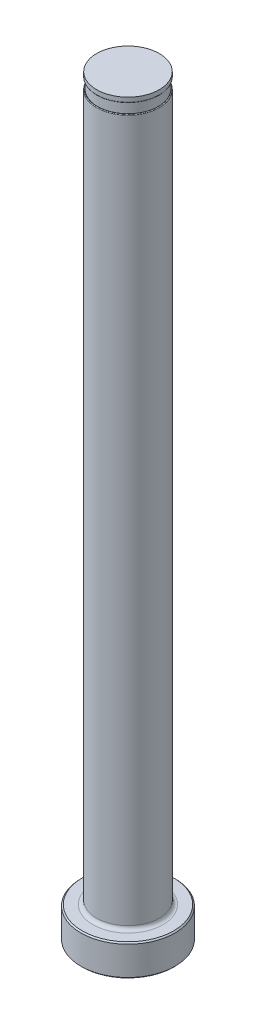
ISO-10303-21;
HEADER;
FILE_DESCRIPTION(('STEP AP214'),'2;1');
FILE_NAME('part.step','',(''),(''),'','','');
FILE_SCHEMA(('AUTOMOTIVE_DESIGN { 1 0 10303 214 1 1 1 1 }'));
ENDSEC;
DATA;
#1=APPLICATION_CONTEXT('core data for automotive mechanical design processes');
#2=APPLICATION_PROTOCOL_DEFINITION('international standard','automotive_design',2000,#1);
#3=PRODUCT_CONTEXT('',#1,'mechanical');
#4=PRODUCT('Part','Part','',(#3));
#5=PRODUCT_RELATED_PRODUCT_CATEGORY('part','',(#4));
#6=PRODUCT_DEFINITION_FORMATION('','',#4);
#7=PRODUCT_DEFINITION_CONTEXT('part definition',#1,'design');
#8=PRODUCT_DEFINITION('design','',#6,#7);
#9=PRODUCT_DEFINITION_SHAPE('','',#8);
#10=(LENGTH_UNIT() NAMED_UNIT(*) SI_UNIT(.MILLI.,.METRE.));
#11=(NAMED_UNIT(*) PLANE_ANGLE_UNIT() SI_UNIT($,.RADIAN.));
#12=(NAMED_UNIT(*) SI_UNIT($,.STERADIAN.) SOLID_ANGLE_UNIT());
#13=UNCERTAINTY_MEASURE_WITH_UNIT(LENGTH_MEASURE(1.E-05),#10,'distance_accuracy_value','');
#14=(GEOMETRIC_REPRESENTATION_CONTEXT(3) GLOBAL_UNCERTAINTY_ASSIGNED_CONTEXT((#13)) GLOBAL_UNIT_ASSIGNED_CONTEXT((#10,
#11,#12)) REPRESENTATION_CONTEXT('',''));
#15=CARTESIAN_POINT('',(0.,0.,0.));
#16=DIRECTION('',(0.,0.,1.));
#17=DIRECTION('',(1.,0.,0.));
#18=AXIS2_PLACEMENT_3D('',#15,#16,#17);
#19=CARTESIAN_POINT('',(-6.34999999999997,151.384,0.));
#20=DIRECTION('',(0.,1.,0.));
#21=DIRECTION('',(0.,0.,1.));
#22=AXIS2_PLACEMENT_3D('',#19,#20,#21);
#23=PLANE('',#22);
#24=CARTESIAN_POINT('',(0.,151.384,0.));
#25=DIRECTION('',(0.,1.,0.));
#26=DIRECTION('',(0.,0.,1.));
#27=AXIS2_PLACEMENT_3D('',#24,#25,#26);
#28=CIRCLE('',#27,6.21791999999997);
#29=CARTESIAN_POINT('',(0.,151.384,6.21791999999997));
#30=VERTEX_POINT('',#29);
#31=EDGE_CURVE('E11',#30,#30,#28,.F.);
#32=ORIENTED_EDGE('',*,*,#31,.T.);
#33=EDGE_LOOP('',(#32));
#34=FACE_BOUND('',#33,.T.);
#35=CARTESIAN_POINT('',(0.,151.384,0.));
#36=DIRECTION('',(0.,1.,0.));
#37=DIRECTION('',(0.,0.,1.));
#38=AXIS2_PLACEMENT_3D('',#35,#36,#37);
#39=CIRCLE('',#38,6.14679999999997);
#40=CARTESIAN_POINT('',(0.,151.384,6.14679999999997));
#41=VERTEX_POINT('',#40);
#42=EDGE_CURVE('E78',#41,#41,#39,.T.);
#43=ORIENTED_EDGE('',*,*,#42,.T.);
#44=EDGE_LOOP('',(#43));
#45=FACE_BOUND('',#44,.T.);
#46=ADVANCED_FACE('F36',(#34,#45),#23,.F.);
#47=CARTESIAN_POINT('',(0.,259.958771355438,0.));
#48=DIRECTION('',(0.,1.,0.));
#49=DIRECTION('',(0.,0.,1.));
#50=AXIS2_PLACEMENT_3D('',#47,#48,#49);
#51=CYLINDRICAL_SURFACE('',#50,6.34999999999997);
#52=DIRECTION('',(0.,1.,0.));
#53=VECTOR('',#52,1.);
#54=CARTESIAN_POINT('',(-6.14679999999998,259.958771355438,-1.59353373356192));
#55=LINE('',#54,#53);
#56=CARTESIAN_POINT('',(-6.14679999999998,149.225,-1.59353373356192));
#57=VERTEX_POINT('',#56);
#58=CARTESIAN_POINT('',(-6.14679999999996,86.868,-1.59353373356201));
#59=VERTEX_POINT('',#58);
#60=EDGE_CURVE('E73',#57,#59,#55,.F.);
#61=ORIENTED_EDGE('',*,*,#60,.F.);
#62=CARTESIAN_POINT('',(0.,149.225,0.));
#63=DIRECTION('',(0.,-1.,0.));
#64=DIRECTION('',(0.,0.,-1.));
#65=AXIS2_PLACEMENT_3D('',#62,#63,#64);
#66=CIRCLE('',#65,6.34999999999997);
#67=CARTESIAN_POINT('',(-6.14679999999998,149.225,1.59353373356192));
#68=VERTEX_POINT('',#67);
#69=EDGE_CURVE('E51',#57,#68,#66,.T.);
#70=ORIENTED_EDGE('',*,*,#69,.T.);
#71=DIRECTION('',(0.,1.,0.));
#72=VECTOR('',#71,1.);
#73=CARTESIAN_POINT('',(-6.14679999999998,259.958771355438,1.59353373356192));
#74=LINE('',#73,#72);
#75=CARTESIAN_POINT('',(-6.14679999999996,86.868,1.59353373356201));
#76=VERTEX_POINT('',#75);
#77=EDGE_CURVE('E84',#76,#68,#74,.T.);
#78=ORIENTED_EDGE('',*,*,#77,.F.);
#79=CARTESIAN_POINT('',(-6.14679999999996,86.868,-1.59353373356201));
#80=CARTESIAN_POINT('',(-6.14679686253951,86.8404663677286,-1.59353938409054));
#81=CARTESIAN_POINT('',(-6.14715862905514,86.8129529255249,-1.59215087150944));
#82=CARTESIAN_POINT('',(-6.14858031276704,86.7582441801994,-1.58665454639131));
#83=CARTESIAN_POINT('',(-6.1496395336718,86.7310485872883,-1.58254944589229));
#84=CARTESIAN_POINT('',(-6.15378495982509,86.6508935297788,-1.56638373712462));
#85=CARTESIAN_POINT('',(-6.15784047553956,86.5987192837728,-1.55046902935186));
#86=CARTESIAN_POINT('',(-6.16796669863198,86.4985368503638,-1.50967436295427));
#87=CARTESIAN_POINT('',(-6.17403041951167,86.4505149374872,-1.48482546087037));
#88=CARTESIAN_POINT('',(-6.18749023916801,86.3592134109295,-1.42770042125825));
#89=CARTESIAN_POINT('',(-6.19488985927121,86.3159468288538,-1.39540459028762));
#90=CARTESIAN_POINT('',(-6.2128308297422,86.2215154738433,-1.31357934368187));
#91=CARTESIAN_POINT('',(-6.22361527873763,86.1723096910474,-1.26185217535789));
#92=CARTESIAN_POINT('',(-6.24504791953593,86.0829285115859,-1.15112070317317));
#93=CARTESIAN_POINT('',(-6.25569585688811,86.0427681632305,-1.09210452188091));
#94=CARTESIAN_POINT('',(-6.27981252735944,85.9571635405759,-0.945436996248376));
#95=CARTESIAN_POINT('',(-6.29280304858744,85.9155705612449,-0.855464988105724));
#96=CARTESIAN_POINT('',(-6.3152685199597,85.84688021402,-0.66983216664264));
#97=CARTESIAN_POINT('',(-6.32474033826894,85.8197957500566,-0.574166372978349));
#98=CARTESIAN_POINT('',(-6.33958312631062,85.7782724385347,-0.377105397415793));
#99=CARTESIAN_POINT('',(-6.34483489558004,85.764199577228,-0.275625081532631));
#100=CARTESIAN_POINT('',(-6.35041977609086,85.7492595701,-0.0715187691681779));
#101=CARTESIAN_POINT('',(-6.35074885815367,85.748403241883,0.0311080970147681));
#102=CARTESIAN_POINT('',(-6.34600640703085,85.7610416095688,0.256717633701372));
#103=CARTESIAN_POINT('',(-6.33980431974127,85.7775397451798,0.379522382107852));
#104=CARTESIAN_POINT('',(-6.32079279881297,85.8309790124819,0.620117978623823));
#105=CARTESIAN_POINT('',(-6.30799326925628,85.8678895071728,0.737916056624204));
#106=CARTESIAN_POINT('',(-6.28320612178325,85.9468252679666,0.921417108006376));
#107=CARTESIAN_POINT('',(-6.27266140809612,85.9819385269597,0.990304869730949));
#108=CARTESIAN_POINT('',(-6.25047734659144,86.0621826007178,1.12180209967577));
#109=CARTESIAN_POINT('',(-6.23883987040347,86.1072964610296,1.18442193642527));
#110=CARTESIAN_POINT('',(-6.21836351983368,86.1965218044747,1.28706750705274));
#111=CARTESIAN_POINT('',(-6.20949901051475,86.2384586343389,1.32897137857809));
#112=CARTESIAN_POINT('',(-6.19260904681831,86.328662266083,1.40556985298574));
#113=CARTESIAN_POINT('',(-6.18458268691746,86.3769221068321,1.44027227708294));
#114=CARTESIAN_POINT('',(-6.17157345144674,86.469899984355,1.49493371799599));
#115=CARTESIAN_POINT('',(-6.16630262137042,86.5136744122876,1.51642497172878));
#116=CARTESIAN_POINT('',(-6.1574469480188,86.6042717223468,1.55199425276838));
#117=CARTESIAN_POINT('',(-6.15385883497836,86.6510884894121,1.56608666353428));
#118=CARTESIAN_POINT('',(-6.14982923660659,86.7265672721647,1.58181403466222));
#119=CARTESIAN_POINT('',(-6.14869942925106,86.7546434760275,1.58619374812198));
#120=CARTESIAN_POINT('',(-6.14718237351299,86.8111398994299,1.59205902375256));
#121=CARTESIAN_POINT('',(-6.14679576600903,86.8395603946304,1.59354208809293));
#122=CARTESIAN_POINT('',(-6.14679999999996,86.868,1.59353373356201));
#123=B_SPLINE_CURVE_WITH_KNOTS('',3,(#79,#80,#81,#82,#83,#84,#85,#86,#87,#88,#89,#90,#91,#92,
#93,#94,#95,#96,#97,#98,#99,#100,#101,#102,#103,#104,#105,#106,#107,#108,#109,#110,#111,#112,
#113,#114,#115,#116,#117,#118,#119,#120,#121,#122),.UNSPECIFIED.,.F.,.F.,(4,2,2,2,2,2,2,2,2,2,2,
2,2,2,2,2,2,2,2,2,2,4),(0.,0.0825255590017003,0.16496885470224,0.327951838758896,
0.490373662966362,0.653230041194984,0.868657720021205,1.08444118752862,1.38273372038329,
1.68129111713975,1.9880112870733,2.29498249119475,2.66541500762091,3.03529304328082,
3.26869881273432,3.50171186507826,3.68091203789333,3.85991655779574,4.00647458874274,
4.15274664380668,4.23791544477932,4.32315765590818),.UNSPECIFIED.);
#124=EDGE_CURVE('E81',#59,#76,#123,.T.);
#125=ORIENTED_EDGE('',*,*,#124,.F.);
#126=EDGE_LOOP('',(#61,#70,#78,#125));
#127=FACE_BOUND('',#126,.T.);
#128=CARTESIAN_POINT('',(0.,7.11200000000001,0.));
#129=DIRECTION('',(0.,1.,0.));
#130=DIRECTION('',(0.,0.,1.));
#131=AXIS2_PLACEMENT_3D('',#128,#129,#130);
#132=CIRCLE('',#131,6.34999999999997);
#133=CARTESIAN_POINT('',(0.,7.11200000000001,6.34999999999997));
#134=VERTEX_POINT('',#133);
#135=EDGE_CURVE('E116',#134,#134,#132,.T.);
#136=ORIENTED_EDGE('',*,*,#135,.T.);
#137=EDGE_LOOP('',(#136));
#138=FACE_BOUND('',#137,.T.);
#139=ADVANCED_FACE('F82',(#127,#138),#51,.T.);
#140=CARTESIAN_POINT('',(0.,0.,0.));
#141=DIRECTION('',(0.,-1.,0.));
#142=DIRECTION('',(0.,0.,-1.));
#143=AXIS2_PLACEMENT_3D('',#140,#141,#142);
#144=PLANE('',#143);
#145=CARTESIAN_POINT('',(0.,0.,0.));
#146=DIRECTION('',(0.,-1.,0.));
#147=DIRECTION('',(0.,0.,-1.));
#148=AXIS2_PLACEMENT_3D('',#145,#146,#147);
#149=CIRCLE('',#148,9.271);
#150=CARTESIAN_POINT('',(0.,0.,-9.271));
#151=VERTEX_POINT('',#150);
#152=EDGE_CURVE('E113',#151,#151,#149,.T.);
#153=ORIENTED_EDGE('',*,*,#152,.T.);
#154=EDGE_LOOP('',(#153));
#155=FACE_BOUND('',#154,.T.);
#156=ADVANCED_FACE('F192',(#155),#144,.T.);
#157=CARTESIAN_POINT('',(0.,259.958771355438,0.));
#158=DIRECTION('',(0.,1.,0.));
#159=DIRECTION('',(0.,0.,1.));
#160=AXIS2_PLACEMENT_3D('',#157,#158,#159);
#161=CYLINDRICAL_SURFACE('',#160,9.52499999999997);
#162=CARTESIAN_POINT('',(0.,6.09600000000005,0.));
#163=DIRECTION('',(0.,1.,0.));
#164=DIRECTION('',(0.,0.,1.));
#165=AXIS2_PLACEMENT_3D('',#162,#163,#164);
#166=CIRCLE('',#165,9.52499999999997);
#167=CARTESIAN_POINT('',(0.,6.09600000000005,9.52499999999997));
#168=VERTEX_POINT('',#167);
#169=EDGE_CURVE('E110',#168,#168,#166,.F.);
#170=ORIENTED_EDGE('',*,*,#169,.T.);
#171=EDGE_LOOP('',(#170));
#172=FACE_BOUND('',#171,.T.);
#173=CARTESIAN_POINT('',(0.,0.253999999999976,0.));
#174=DIRECTION('',(0.,-1.,0.));
#175=DIRECTION('',(0.,0.,-1.));
#176=AXIS2_PLACEMENT_3D('',#173,#174,#175);
#177=CIRCLE('',#176,9.52499999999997);
#178=CARTESIAN_POINT('',(0.,0.253999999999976,-9.52499999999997));
#179=VERTEX_POINT('',#178);
#180=EDGE_CURVE('E107',#179,#179,#177,.F.);
#181=ORIENTED_EDGE('',*,*,#180,.T.);
#182=EDGE_LOOP('',(#181));
#183=FACE_BOUND('',#182,.T.);
#184=ADVANCED_FACE('F195',(#172,#183),#161,.T.);
#185=CARTESIAN_POINT('',(-9.52499999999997,6.35,0.));
#186=DIRECTION('',(0.,1.,0.));
#187=DIRECTION('',(0.,0.,1.));
#188=AXIS2_PLACEMENT_3D('',#185,#186,#187);
#189=PLANE('',#188);
#190=CARTESIAN_POINT('',(0.,6.35,0.));
#191=DIRECTION('',(0.,1.,0.));
#192=DIRECTION('',(0.,0.,1.));
#193=AXIS2_PLACEMENT_3D('',#190,#191,#192);
#194=CIRCLE('',#193,7.11199999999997);
#195=CARTESIAN_POINT('',(0.,6.35,7.11199999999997));
#196=VERTEX_POINT('',#195);
#197=EDGE_CURVE('E87',#196,#196,#194,.F.);
#198=ORIENTED_EDGE('',*,*,#197,.T.);
#199=EDGE_LOOP('',(#198));
#200=FACE_BOUND('',#199,.T.);
#201=CARTESIAN_POINT('',(0.,6.35,0.));
#202=DIRECTION('',(0.,1.,0.));
#203=DIRECTION('',(0.,0.,1.));
#204=AXIS2_PLACEMENT_3D('',#201,#202,#203);
#205=CIRCLE('',#204,9.27100000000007);
#206=CARTESIAN_POINT('',(0.,6.35,9.27100000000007));
#207=VERTEX_POINT('',#206);
#208=EDGE_CURVE('E104',#207,#207,#205,.T.);
#209=ORIENTED_EDGE('',*,*,#208,.T.);
#210=EDGE_LOOP('',(#209));
#211=FACE_BOUND('',#210,.T.);
#212=ADVANCED_FACE('F190',(#200,#211),#189,.T.);
#213=CARTESIAN_POINT('',(0.,6.35000000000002,0.));
#214=DIRECTION('',(0.,-1.,0.));
#215=DIRECTION('',(0.,0.,-1.));
#216=AXIS2_PLACEMENT_3D('',#213,#214,#215);
#217=CONICAL_SURFACE('',#216,9.27100000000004,0.785398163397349);
#218=ORIENTED_EDGE('',*,*,#169,.F.);
#219=EDGE_LOOP('',(#218));
#220=FACE_BOUND('',#219,.T.);
#221=ORIENTED_EDGE('',*,*,#208,.F.);
#222=EDGE_LOOP('',(#221));
#223=FACE_BOUND('',#222,.T.);
#224=ADVANCED_FACE('F186',(#220,#223),#217,.T.);
#225=CARTESIAN_POINT('',(0.,0.253999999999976,0.));
#226=DIRECTION('',(0.,1.,0.));
#227=DIRECTION('',(0.,0.,1.));
#228=AXIS2_PLACEMENT_3D('',#225,#226,#227);
#229=CONICAL_SURFACE('',#228,9.52499999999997,0.785398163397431);
#230=ORIENTED_EDGE('',*,*,#152,.F.);
#231=EDGE_LOOP('',(#230));
#232=FACE_BOUND('',#231,.T.);
#233=ORIENTED_EDGE('',*,*,#180,.F.);
#234=EDGE_LOOP('',(#233));
#235=FACE_BOUND('',#234,.T.);
#236=ADVANCED_FACE('F182',(#232,#235),#229,.T.);
#237=CARTESIAN_POINT('',(0.,7.11200000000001,0.));
#238=DIRECTION('',(0.,1.,0.));
#239=DIRECTION('',(0.,0.,1.));
#240=AXIS2_PLACEMENT_3D('',#237,#238,#239);
#241=TOROIDAL_SURFACE('',#240,7.11199999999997,0.762);
#242=ORIENTED_EDGE('',*,*,#197,.F.);
#243=EDGE_LOOP('',(#242));
#244=FACE_BOUND('',#243,.T.);
#245=ORIENTED_EDGE('',*,*,#135,.F.);
#246=EDGE_LOOP('',(#245));
#247=FACE_BOUND('',#246,.T.);
#248=ADVANCED_FACE('F147',(#244,#247),#241,.F.);
#249=CARTESIAN_POINT('',(-6.34999999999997,149.352,0.));
#250=DIRECTION('',(0.,-1.,0.));
#251=DIRECTION('',(0.,0.,-1.));
#252=AXIS2_PLACEMENT_3D('',#249,#250,#251);
#253=PLANE('',#252);
#254=DIRECTION('',(0.,0.,1.));
#255=VECTOR('',#254,1.);
#256=CARTESIAN_POINT('',(-6.14679999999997,149.352,0.));
#257=LINE('',#256,#255);
#258=CARTESIAN_POINT('',(-6.14679999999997,149.352,0.));
#259=VERTEX_POINT('',#258);
#260=CARTESIAN_POINT('',(-6.14679999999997,149.352,0.970864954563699));
#261=VERTEX_POINT('',#260);
#262=EDGE_CURVE('E90',#259,#261,#257,.T.);
#263=ORIENTED_EDGE('',*,*,#262,.T.);
#264=CARTESIAN_POINT('',(0.,149.352,0.));
#265=DIRECTION('',(0.,-1.,0.));
#266=DIRECTION('',(0.,0.,-1.));
#267=AXIS2_PLACEMENT_3D('',#264,#265,#266);
#268=CIRCLE('',#267,6.22299999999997);
#269=CARTESIAN_POINT('',(-6.14679999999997,149.352,-0.970864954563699));
#270=VERTEX_POINT('',#269);
#271=EDGE_CURVE('E86',#261,#270,#268,.F.);
#272=ORIENTED_EDGE('',*,*,#271,.T.);
#273=EDGE_CURVE('E79',#270,#259,#257,.T.);
#274=ORIENTED_EDGE('',*,*,#273,.T.);
#275=CARTESIAN_POINT('',(0.,149.352,0.));
#276=DIRECTION('',(0.,1.,0.));
#277=DIRECTION('',(0.,0.,1.));
#278=AXIS2_PLACEMENT_3D('',#275,#276,#277);
#279=CIRCLE('',#278,6.14679999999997);
#280=EDGE_CURVE('E101',#259,#259,#279,.T.);
#281=ORIENTED_EDGE('',*,*,#280,.F.);
#282=EDGE_LOOP('',(#263,#272,#274,#281));
#283=FACE_BOUND('',#282,.T.);
#284=ADVANCED_FACE('F144',(#283),#253,.F.);
#285=CARTESIAN_POINT('',(0.,153.448281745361,0.));
#286=DIRECTION('',(0.,1.,0.));
#287=DIRECTION('',(0.,0.,1.));
#288=AXIS2_PLACEMENT_3D('',#285,#286,#287);
#289=CYLINDRICAL_SURFACE('',#288,6.14679999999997);
#290=ORIENTED_EDGE('',*,*,#42,.F.);
#291=EDGE_LOOP('',(#290));
#292=FACE_BOUND('',#291,.T.);
#293=ORIENTED_EDGE('',*,*,#280,.T.);
#294=EDGE_LOOP('',(#293));
#295=FACE_BOUND('',#294,.T.);
#296=ADVANCED_FACE('F141',(#292,#295),#289,.T.);
#297=CARTESIAN_POINT('',(-6.14679999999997,150.368,-9.52499999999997));
#298=DIRECTION('',(1.,0.,0.));
#299=DIRECTION('',(0.,1.,0.));
#300=AXIS2_PLACEMENT_3D('',#297,#298,#299);
#301=PLANE('',#300);
#302=ORIENTED_EDGE('',*,*,#273,.F.);
#303=CARTESIAN_POINT('',(-6.14679999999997,149.352,-0.970864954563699));
#304=CARTESIAN_POINT('',(-6.14679999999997,149.351999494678,-0.992028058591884));
#305=CARTESIAN_POINT('',(-6.14679999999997,149.35187177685,-1.01319058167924));
#306=CARTESIAN_POINT('',(-6.14679999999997,149.351304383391,-1.0555164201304));
#307=CARTESIAN_POINT('',(-6.14679999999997,149.350864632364,-1.07667973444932));
#308=CARTESIAN_POINT('',(-6.14679999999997,149.34898930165,-1.14021803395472));
#309=CARTESIAN_POINT('',(-6.14679999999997,149.346997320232,-1.18258174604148));
#310=CARTESIAN_POINT('',(-6.14679999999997,149.34236583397,-1.2456469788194));
#311=CARTESIAN_POINT('',(-6.14679999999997,149.340570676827,-1.26640955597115));
#312=CARTESIAN_POINT('',(-6.14679999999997,149.336292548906,-1.30785556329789));
#313=CARTESIAN_POINT('',(-6.14679999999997,149.333809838,-1.32853902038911));
#314=CARTESIAN_POINT('',(-6.14679999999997,149.32686463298,-1.37752764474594));
#315=CARTESIAN_POINT('',(-6.14679999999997,149.322008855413,-1.40578261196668));
#316=CARTESIAN_POINT('',(-6.14679999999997,149.311486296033,-1.45315312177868));
#317=CARTESIAN_POINT('',(-6.14679999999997,149.306522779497,-1.47241873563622));
#318=CARTESIAN_POINT('',(-6.14679999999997,149.296243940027,-1.50466142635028));
#319=CARTESIAN_POINT('',(-6.14679999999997,149.291474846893,-1.51780066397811));
#320=CARTESIAN_POINT('',(-6.14679999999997,149.282759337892,-1.53746298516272));
#321=CARTESIAN_POINT('',(-6.14679999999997,149.279436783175,-1.54425972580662));
#322=CARTESIAN_POINT('',(-6.14679999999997,149.272050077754,-1.55743156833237));
#323=CARTESIAN_POINT('',(-6.14679999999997,149.267989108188,-1.56380832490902));
#324=CARTESIAN_POINT('',(-6.14679999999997,149.261517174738,-1.57208690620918));
#325=CARTESIAN_POINT('',(-6.14679999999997,149.259591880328,-1.57436448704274));
#326=CARTESIAN_POINT('',(-6.14679999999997,149.255512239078,-1.57872030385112));
#327=CARTESIAN_POINT('',(-6.14679999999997,149.253357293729,-1.5807979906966));
#328=CARTESIAN_POINT('',(-6.14679999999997,149.248744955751,-1.58467787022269));
#329=CARTESIAN_POINT('',(-6.14679999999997,149.246283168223,-1.58647496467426));
#330=CARTESIAN_POINT('',(-6.14679999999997,149.241073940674,-1.58956779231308));
#331=CARTESIAN_POINT('',(-6.14679999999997,149.238329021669,-1.59086753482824));
#332=CARTESIAN_POINT('',(-6.14679999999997,149.233789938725,-1.59236406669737));
#333=CARTESIAN_POINT('',(-6.14679999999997,149.232073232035,-1.5927947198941));
#334=CARTESIAN_POINT('',(-6.14679999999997,149.228573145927,-1.59338315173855));
#335=CARTESIAN_POINT('',(-6.14679999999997,149.226789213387,-1.59353759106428));
#336=CARTESIAN_POINT('',(-6.14679999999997,149.225,-1.59353373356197));
#337=B_SPLINE_CURVE_WITH_KNOTS('',3,(#303,#304,#305,#306,#307,#308,#309,#310,#311,#312,#313,
#314,#315,#316,#317,#318,#319,#320,#321,#322,#323,#324,#325,#326,#327,#328,#329,#330,#331,#332,
#333,#334,#335,#336),.UNSPECIFIED.,.F.,.F.,(4,2,2,2,2,2,2,2,2,2,2,2,2,2,2,2,4),(0.,
0.0634873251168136,0.1269899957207,0.254174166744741,0.316684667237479,0.379171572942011,
0.465088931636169,0.524705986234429,0.566546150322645,0.589220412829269,0.611799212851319,
0.620735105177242,0.629694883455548,0.638802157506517,0.647834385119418,0.653123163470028,
0.658475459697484),.UNSPECIFIED.);
#338=EDGE_CURVE('E59',#270,#57,#337,.T.);
#339=ORIENTED_EDGE('',*,*,#338,.T.);
#340=ORIENTED_EDGE('',*,*,#60,.T.);
#341=DIRECTION('',(0.,0.,1.));
#342=VECTOR('',#341,1.);
#343=CARTESIAN_POINT('',(-6.14679999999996,86.868,-9.52499999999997));
#344=LINE('',#343,#342);
#345=EDGE_CURVE('E77',#59,#76,#344,.T.);
#346=ORIENTED_EDGE('',*,*,#345,.T.);
#347=ORIENTED_EDGE('',*,*,#77,.T.);
#348=CARTESIAN_POINT('',(-6.14679999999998,149.225,1.59353373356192));
#349=CARTESIAN_POINT('',(-6.14679999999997,149.227212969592,1.59354190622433));
#350=CARTESIAN_POINT('',(-6.14679999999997,149.229413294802,1.59330365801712));
#351=CARTESIAN_POINT('',(-6.14679999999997,149.2336934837,1.59241515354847));
#352=CARTESIAN_POINT('',(-6.14679999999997,149.235774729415,1.59177170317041));
#353=CARTESIAN_POINT('',(-6.14679999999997,149.240264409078,1.58996085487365));
#354=CARTESIAN_POINT('',(-6.14679999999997,149.242636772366,1.58870654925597));
#355=CARTESIAN_POINT('',(-6.14679999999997,149.247163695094,1.58583480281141));
#356=CARTESIAN_POINT('',(-6.14679999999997,149.249316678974,1.58421497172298));
#357=CARTESIAN_POINT('',(-6.14679999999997,149.255009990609,1.57937157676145));
#358=CARTESIAN_POINT('',(-6.14679999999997,149.258321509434,1.57588310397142));
#359=CARTESIAN_POINT('',(-6.14679999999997,149.264438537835,1.56850014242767));
#360=CARTESIAN_POINT('',(-6.14679999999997,149.26724308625,1.56460490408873));
#361=CARTESIAN_POINT('',(-6.14679999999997,149.27393924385,1.55433442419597));
#362=CARTESIAN_POINT('',(-6.14679999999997,149.277564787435,1.54778763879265));
#363=CARTESIAN_POINT('',(-6.14679999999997,149.284209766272,1.5343888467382));
#364=CARTESIAN_POINT('',(-6.14679999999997,149.287227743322,1.52753615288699));
#365=CARTESIAN_POINT('',(-6.14679999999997,149.295649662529,1.50664917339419));
#366=CARTESIAN_POINT('',(-6.14679999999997,149.300386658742,1.49234856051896));
#367=CARTESIAN_POINT('',(-6.14679999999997,149.308853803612,1.46319301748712));
#368=CARTESIAN_POINT('',(-6.14679999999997,149.312564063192,1.44833273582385));
#369=CARTESIAN_POINT('',(-6.14679999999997,149.319191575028,1.41843325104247));
#370=CARTESIAN_POINT('',(-6.14679999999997,149.322108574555,1.40339399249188));
#371=CARTESIAN_POINT('',(-6.14679999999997,149.329988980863,1.3580554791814));
#372=CARTESIAN_POINT('',(-6.14679999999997,149.334064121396,1.32760471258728));
#373=CARTESIAN_POINT('',(-6.14679999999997,149.340693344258,1.26653961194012));
#374=CARTESIAN_POINT('',(-6.14679999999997,149.343246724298,1.23592520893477));
#375=CARTESIAN_POINT('',(-6.14679999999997,149.347251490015,1.1746618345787));
#376=CARTESIAN_POINT('',(-6.14679999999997,149.348704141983,1.1440129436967));
#377=CARTESIAN_POINT('',(-6.14679999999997,149.350556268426,1.08956123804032));
#378=CARTESIAN_POINT('',(-6.14679999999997,149.351118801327,1.06576333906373));
#379=CARTESIAN_POINT('',(-6.14679999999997,149.35183839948,1.01826491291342));
#380=CARTESIAN_POINT('',(-6.14679999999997,149.351997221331,0.994564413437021));
#381=CARTESIAN_POINT('',(-6.14679999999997,149.352,0.9708649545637));
#382=B_SPLINE_CURVE_WITH_KNOTS('',3,(#348,#349,#350,#351,#352,#353,#354,#355,#356,#357,#358,
#359,#360,#361,#362,#363,#364,#365,#366,#367,#368,#369,#370,#371,#372,#373,#374,#375,#376,#377,
#378,#379,#380,#381),.UNSPECIFIED.,.F.,.F.,(4,2,2,2,2,2,2,2,2,2,2,2,2,2,2,2,4),(0.,
0.0066059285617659,0.0131037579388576,0.021108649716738,0.0291674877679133,0.0435165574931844,
0.0578925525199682,0.0802861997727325,0.102732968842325,0.147839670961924,0.193767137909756,
0.23970922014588,0.331806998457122,0.423947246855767,0.51598133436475,0.587391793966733,
0.658491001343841),.UNSPECIFIED.);
#383=EDGE_CURVE('E172',#68,#261,#382,.T.);
#384=ORIENTED_EDGE('',*,*,#383,.T.);
#385=ORIENTED_EDGE('',*,*,#262,.F.);
#386=EDGE_LOOP('',(#302,#339,#340,#346,#347,#384,#385));
#387=FACE_BOUND('',#386,.T.);
#388=ADVANCED_FACE('F75',(#387),#301,.F.);
#389=CARTESIAN_POINT('',(-9.32179999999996,86.868,-9.52499999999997));
#390=DIRECTION('',(0.,0.,1.));
#391=DIRECTION('',(1.,0.,0.));
#392=AXIS2_PLACEMENT_3D('',#389,#390,#391);
#393=CYLINDRICAL_SURFACE('',#392,3.175);
#394=ORIENTED_EDGE('',*,*,#345,.F.);
#395=ORIENTED_EDGE('',*,*,#124,.T.);
#396=EDGE_LOOP('',(#394,#395));
#397=FACE_BOUND('',#396,.T.);
#398=ADVANCED_FACE('F89',(#397),#393,.F.);
#399=CARTESIAN_POINT('',(0.,152.687735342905,0.));
#400=DIRECTION('',(0.,1.,0.));
#401=DIRECTION('',(0.,0.,1.));
#402=AXIS2_PLACEMENT_3D('',#399,#400,#401);
#403=CYLINDRICAL_SURFACE('',#402,6.34491999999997);
#404=CARTESIAN_POINT('',(0.,151.511,0.));
#405=DIRECTION('',(0.,1.,0.));
#406=DIRECTION('',(0.,0.,1.));
#407=AXIS2_PLACEMENT_3D('',#404,#405,#406);
#408=CIRCLE('',#407,6.34491999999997);
#409=CARTESIAN_POINT('',(0.,151.511,6.34491999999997));
#410=VERTEX_POINT('',#409);
#411=EDGE_CURVE('E44',#410,#410,#408,.T.);
#412=ORIENTED_EDGE('',*,*,#411,.T.);
#413=EDGE_LOOP('',(#412));
#414=FACE_BOUND('',#413,.T.);
#415=CARTESIAN_POINT('',(0.,152.4,0.));
#416=DIRECTION('',(0.,1.,0.));
#417=DIRECTION('',(0.,0.,1.));
#418=AXIS2_PLACEMENT_3D('',#415,#416,#417);
#419=CIRCLE('',#418,6.34491999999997);
#420=CARTESIAN_POINT('',(0.,152.4,6.34491999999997));
#421=VERTEX_POINT('',#420);
#422=EDGE_CURVE('E91',#421,#421,#419,.T.);
#423=ORIENTED_EDGE('',*,*,#422,.F.);
#424=EDGE_LOOP('',(#423));
#425=FACE_BOUND('',#424,.T.);
#426=ADVANCED_FACE('F135',(#414,#425),#403,.T.);
#427=CARTESIAN_POINT('',(-6.34999999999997,152.4,0.));
#428=DIRECTION('',(0.,1.,0.));
#429=DIRECTION('',(0.,0.,1.));
#430=AXIS2_PLACEMENT_3D('',#427,#428,#429);
#431=PLANE('',#430);
#432=ORIENTED_EDGE('',*,*,#422,.T.);
#433=EDGE_LOOP('',(#432));
#434=FACE_BOUND('',#433,.T.);
#435=ADVANCED_FACE('F149',(#434),#431,.T.);
#436=CARTESIAN_POINT('',(0.,149.225,0.));
#437=DIRECTION('',(0.,-1.,0.));
#438=DIRECTION('',(0.,0.,-1.));
#439=AXIS2_PLACEMENT_3D('',#436,#437,#438);
#440=TOROIDAL_SURFACE('',#439,6.22299999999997,0.127);
#441=ORIENTED_EDGE('',*,*,#383,.F.);
#442=ORIENTED_EDGE('',*,*,#69,.F.);
#443=ORIENTED_EDGE('',*,*,#338,.F.);
#444=ORIENTED_EDGE('',*,*,#271,.F.);
#445=EDGE_LOOP('',(#441,#442,#443,#444));
#446=FACE_BOUND('',#445,.T.);
#447=ADVANCED_FACE('F151',(#446),#440,.T.);
#448=CARTESIAN_POINT('',(0.,151.511,0.));
#449=DIRECTION('',(0.,1.,0.));
#450=DIRECTION('',(0.,0.,1.));
#451=AXIS2_PLACEMENT_3D('',#448,#449,#450);
#452=TOROIDAL_SURFACE('',#451,6.21791999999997,0.127);
#453=ORIENTED_EDGE('',*,*,#31,.F.);
#454=EDGE_LOOP('',(#453));
#455=FACE_BOUND('',#454,.T.);
#456=ORIENTED_EDGE('',*,*,#411,.F.);
#457=EDGE_LOOP('',(#456));
#458=FACE_BOUND('',#457,.T.);
#459=ADVANCED_FACE('F38',(#455,#458),#452,.T.);
#460=CLOSED_SHELL('',(#46,#139,#156,#184,#212,#224,#236,#248,#284,#296,#388,#398,#426,#435,#447,#459));
#461=MANIFOLD_SOLID_BREP('B2',#460);
#462=ADVANCED_BREP_SHAPE_REPRESENTATION('',(#18,#461),#14);
#463=SHAPE_DEFINITION_REPRESENTATION(#9,#462);
ENDSEC;
END-ISO-10303-21;
